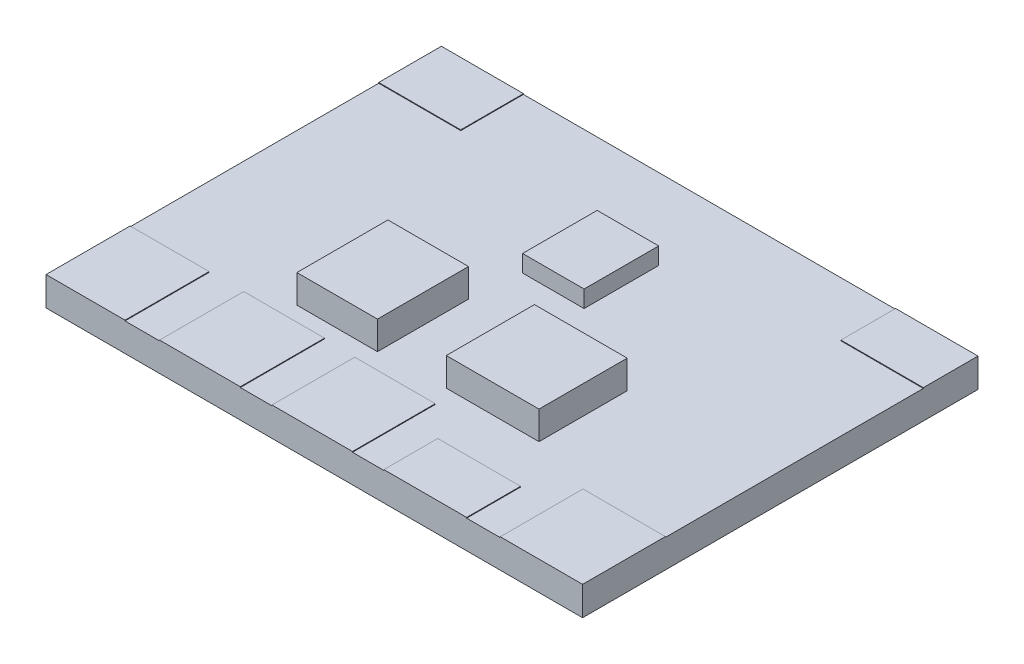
ISO-10303-21;
HEADER;
FILE_DESCRIPTION(('STEP AP214'),'2;1');
FILE_NAME('part.step','',(''),(''),'','','');
FILE_SCHEMA(('AUTOMOTIVE_DESIGN { 1 0 10303 214 1 1 1 1 }'));
ENDSEC;
DATA;
#1=APPLICATION_CONTEXT('core data for automotive mechanical design processes');
#2=APPLICATION_PROTOCOL_DEFINITION('international standard','automotive_design',2000,#1);
#3=PRODUCT_CONTEXT('',#1,'mechanical');
#4=PRODUCT('Part','Part','',(#3));
#5=PRODUCT_RELATED_PRODUCT_CATEGORY('part','',(#4));
#6=PRODUCT_DEFINITION_FORMATION('','',#4);
#7=PRODUCT_DEFINITION_CONTEXT('part definition',#1,'design');
#8=PRODUCT_DEFINITION('design','',#6,#7);
#9=PRODUCT_DEFINITION_SHAPE('','',#8);
#10=(LENGTH_UNIT() NAMED_UNIT(*) SI_UNIT(.MILLI.,.METRE.));
#11=(NAMED_UNIT(*) PLANE_ANGLE_UNIT() SI_UNIT($,.RADIAN.));
#12=(NAMED_UNIT(*) SI_UNIT($,.STERADIAN.) SOLID_ANGLE_UNIT());
#13=UNCERTAINTY_MEASURE_WITH_UNIT(LENGTH_MEASURE(1.E-05),#10,'distance_accuracy_value','');
#14=(GEOMETRIC_REPRESENTATION_CONTEXT(3) GLOBAL_UNCERTAINTY_ASSIGNED_CONTEXT((#13)) GLOBAL_UNIT_ASSIGNED_CONTEXT((#10,
#11,#12)) REPRESENTATION_CONTEXT('',''));
#15=CARTESIAN_POINT('',(0.,0.,0.));
#16=DIRECTION('',(0.,0.,1.));
#17=DIRECTION('',(1.,0.,0.));
#18=AXIS2_PLACEMENT_3D('',#15,#16,#17);
#19=CARTESIAN_POINT('',(0.,2.,0.));
#20=DIRECTION('',(0.,1.,0.));
#21=DIRECTION('',(0.,0.,1.));
#22=AXIS2_PLACEMENT_3D('',#19,#20,#21);
#23=PLANE('',#22);
#24=DIRECTION('',(1.,0.,0.));
#25=VECTOR('',#24,1.);
#26=CARTESIAN_POINT('',(-8.28891681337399,2.,6.94510530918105));
#27=LINE('',#26,#25);
#28=CARTESIAN_POINT('',(-8.28891681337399,2.,6.94510530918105));
#29=VERTEX_POINT('',#28);
#30=CARTESIAN_POINT('',(-2.58045716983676,2.,6.94510530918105));
#31=VERTEX_POINT('',#30);
#32=EDGE_CURVE('E549',#29,#31,#27,.T.);
#33=ORIENTED_EDGE('',*,*,#32,.F.);
#34=DIRECTION('',(0.,0.,1.));
#35=VECTOR('',#34,1.);
#36=CARTESIAN_POINT('',(-8.28891681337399,2.,0.498138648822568));
#37=LINE('',#36,#35);
#38=CARTESIAN_POINT('',(-8.28891681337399,2.,0.498138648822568));
#39=VERTEX_POINT('',#38);
#40=EDGE_CURVE('E535',#39,#29,#37,.T.);
#41=ORIENTED_EDGE('',*,*,#40,.F.);
#42=DIRECTION('',(-1.,0.,0.));
#43=VECTOR('',#42,1.);
#44=CARTESIAN_POINT('',(-8.28891681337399,2.,0.498138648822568));
#45=LINE('',#44,#43);
#46=CARTESIAN_POINT('',(-2.58045716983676,2.,0.498138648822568));
#47=VERTEX_POINT('',#46);
#48=EDGE_CURVE('E540',#47,#39,#45,.T.);
#49=ORIENTED_EDGE('',*,*,#48,.F.);
#50=DIRECTION('',(0.,0.,-1.));
#51=VECTOR('',#50,1.);
#52=CARTESIAN_POINT('',(-2.58045716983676,2.,0.498138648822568));
#53=LINE('',#52,#51);
#54=EDGE_CURVE('E551',#31,#47,#53,.T.);
#55=ORIENTED_EDGE('',*,*,#54,.F.);
#56=EDGE_LOOP('',(#33,#41,#49,#55));
#57=FACE_BOUND('',#56,.T.);
#58=DIRECTION('',(1.,0.,0.));
#59=VECTOR('',#58,1.);
#60=CARTESIAN_POINT('',(2.09010072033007,2.,6.74550881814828));
#61=LINE('',#60,#59);
#62=CARTESIAN_POINT('',(2.09010072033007,2.,6.74550881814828));
#63=VERTEX_POINT('',#62);
#64=CARTESIAN_POINT('',(8.65682527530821,2.,6.74550881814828));
#65=VERTEX_POINT('',#64);
#66=EDGE_CURVE('E520',#63,#65,#61,.T.);
#67=ORIENTED_EDGE('',*,*,#66,.F.);
#68=DIRECTION('',(0.,0.,1.));
#69=VECTOR('',#68,1.);
#70=CARTESIAN_POINT('',(2.09010072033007,2.,0.498138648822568));
#71=LINE('',#70,#69);
#72=CARTESIAN_POINT('',(2.09010072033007,2.,0.498138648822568));
#73=VERTEX_POINT('',#72);
#74=EDGE_CURVE('E506',#73,#63,#71,.T.);
#75=ORIENTED_EDGE('',*,*,#74,.F.);
#76=DIRECTION('',(-1.,0.,0.));
#77=VECTOR('',#76,1.);
#78=CARTESIAN_POINT('',(2.09010072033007,2.,0.498138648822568));
#79=LINE('',#78,#77);
#80=CARTESIAN_POINT('',(8.65682527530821,2.,0.498138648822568));
#81=VERTEX_POINT('',#80);
#82=EDGE_CURVE('E511',#81,#73,#79,.T.);
#83=ORIENTED_EDGE('',*,*,#82,.F.);
#84=DIRECTION('',(0.,0.,-1.));
#85=VECTOR('',#84,1.);
#86=CARTESIAN_POINT('',(8.65682527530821,2.,0.498138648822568));
#87=LINE('',#86,#85);
#88=EDGE_CURVE('E522',#65,#81,#87,.T.);
#89=ORIENTED_EDGE('',*,*,#88,.F.);
#90=EDGE_LOOP('',(#67,#75,#83,#89));
#91=FACE_BOUND('',#90,.T.);
#92=DIRECTION('',(0.,0.,1.));
#93=VECTOR('',#92,1.);
#94=CARTESIAN_POINT('',(-2.26741724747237,2.,-8.29788370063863));
#95=LINE('',#94,#93);
#96=CARTESIAN_POINT('',(-2.26741724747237,2.,-8.29788370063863));
#97=VERTEX_POINT('',#96);
#98=CARTESIAN_POINT('',(-2.26741724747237,2.,-3.0157017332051));
#99=VERTEX_POINT('',#98);
#100=EDGE_CURVE('E491',#97,#99,#95,.T.);
#101=ORIENTED_EDGE('',*,*,#100,.F.);
#102=DIRECTION('',(-1.,0.,0.));
#103=VECTOR('',#102,1.);
#104=CARTESIAN_POINT('',(-2.26741724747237,2.,-8.29788370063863));
#105=LINE('',#104,#103);
#106=CARTESIAN_POINT('',(2.09010072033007,2.,-8.29788370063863));
#107=VERTEX_POINT('',#106);
#108=EDGE_CURVE('E477',#107,#97,#105,.T.);
#109=ORIENTED_EDGE('',*,*,#108,.F.);
#110=DIRECTION('',(0.,0.,-1.));
#111=VECTOR('',#110,1.);
#112=CARTESIAN_POINT('',(2.09010072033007,2.,-8.29788370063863));
#113=LINE('',#112,#111);
#114=CARTESIAN_POINT('',(2.09010072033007,2.,-3.0157017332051));
#115=VERTEX_POINT('',#114);
#116=EDGE_CURVE('E482',#115,#107,#113,.T.);
#117=ORIENTED_EDGE('',*,*,#116,.F.);
#118=DIRECTION('',(1.,0.,0.));
#119=VECTOR('',#118,1.);
#120=CARTESIAN_POINT('',(-2.26741724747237,2.,-3.0157017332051));
#121=LINE('',#120,#119);
#122=EDGE_CURVE('E493',#99,#115,#121,.T.);
#123=ORIENTED_EDGE('',*,*,#122,.F.);
#124=EDGE_LOOP('',(#101,#109,#117,#123));
#125=FACE_BOUND('',#124,.T.);
#126=DIRECTION('',(1.,0.,0.));
#127=VECTOR('',#126,1.);
#128=CARTESIAN_POINT('',(19.,2.,14.));
#129=LINE('',#128,#127);
#130=CARTESIAN_POINT('',(-13.4052461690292,2.,14.));
#131=VERTEX_POINT('',#130);
#132=CARTESIAN_POINT('',(-10.9568034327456,2.,14.));
#133=VERTEX_POINT('',#132);
#134=EDGE_CURVE('E569',#131,#133,#129,.T.);
#135=ORIENTED_EDGE('',*,*,#134,.T.);
#136=DIRECTION('',(0.,0.,1.));
#137=VECTOR('',#136,1.);
#138=CARTESIAN_POINT('',(-10.9568034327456,2.,8.04169922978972));
#139=LINE('',#138,#137);
#140=CARTESIAN_POINT('',(-10.9568034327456,2.,8.04169922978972));
#141=VERTEX_POINT('',#140);
#142=EDGE_CURVE('E56',#141,#133,#139,.T.);
#143=ORIENTED_EDGE('',*,*,#142,.F.);
#144=DIRECTION('',(-1.,0.,0.));
#145=VECTOR('',#144,1.);
#146=CARTESIAN_POINT('',(-10.9568034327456,2.,8.04169922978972));
#147=LINE('',#146,#145);
#148=CARTESIAN_POINT('',(-5.23953587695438,2.,8.04169922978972));
#149=VERTEX_POINT('',#148);
#150=EDGE_CURVE('E51',#149,#141,#147,.T.);
#151=ORIENTED_EDGE('',*,*,#150,.F.);
#152=DIRECTION('',(0.,0.,-1.));
#153=VECTOR('',#152,1.);
#154=CARTESIAN_POINT('',(-5.23953587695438,2.,8.04169922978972));
#155=LINE('',#154,#153);
#156=CARTESIAN_POINT('',(-5.23953587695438,2.,14.));
#157=VERTEX_POINT('',#156);
#158=EDGE_CURVE('E1050',#157,#149,#155,.T.);
#159=ORIENTED_EDGE('',*,*,#158,.F.);
#160=CARTESIAN_POINT('',(-2.99936453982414,2.,14.));
#161=VERTEX_POINT('',#160);
#162=EDGE_CURVE('E572',#157,#161,#129,.T.);
#163=ORIENTED_EDGE('',*,*,#162,.T.);
#164=DIRECTION('',(0.,0.,1.));
#165=VECTOR('',#164,1.);
#166=CARTESIAN_POINT('',(-2.99936453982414,2.,8.13834828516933));
#167=LINE('',#166,#165);
#168=CARTESIAN_POINT('',(-2.99936453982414,2.,8.13834828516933));
#169=VERTEX_POINT('',#168);
#170=EDGE_CURVE('E347',#169,#161,#167,.T.);
#171=ORIENTED_EDGE('',*,*,#170,.F.);
#172=DIRECTION('',(-1.,0.,0.));
#173=VECTOR('',#172,1.);
#174=CARTESIAN_POINT('',(2.70292972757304,2.,8.13834828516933));
#175=LINE('',#174,#173);
#176=CARTESIAN_POINT('',(2.70292972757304,2.,8.13834828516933));
#177=VERTEX_POINT('',#176);
#178=EDGE_CURVE('E356',#177,#169,#175,.T.);
#179=ORIENTED_EDGE('',*,*,#178,.F.);
#180=DIRECTION('',(0.,0.,-1.));
#181=VECTOR('',#180,1.);
#182=CARTESIAN_POINT('',(2.70292972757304,2.,8.13834828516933));
#183=LINE('',#182,#181);
#184=CARTESIAN_POINT('',(2.70292972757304,2.,14.));
#185=VERTEX_POINT('',#184);
#186=EDGE_CURVE('E342',#185,#177,#183,.T.);
#187=ORIENTED_EDGE('',*,*,#186,.F.);
#188=CARTESIAN_POINT('',(4.92585800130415,2.,14.));
#189=VERTEX_POINT('',#188);
#190=EDGE_CURVE('E1057',#185,#189,#129,.T.);
#191=ORIENTED_EDGE('',*,*,#190,.T.);
#192=DIRECTION('',(0.,0.,1.));
#193=VECTOR('',#192,1.);
#194=CARTESIAN_POINT('',(4.92585800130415,2.,10.1840866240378));
#195=LINE('',#194,#193);
#196=CARTESIAN_POINT('',(4.92585800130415,2.,10.1840866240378));
#197=VERTEX_POINT('',#196);
#198=EDGE_CURVE('E377',#197,#189,#195,.T.);
#199=ORIENTED_EDGE('',*,*,#198,.F.);
#200=DIRECTION('',(-1.,0.,0.));
#201=VECTOR('',#200,1.);
#202=CARTESIAN_POINT('',(10.7892340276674,2.,10.1840866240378));
#203=LINE('',#202,#201);
#204=CARTESIAN_POINT('',(10.7892340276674,2.,10.1840866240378));
#205=VERTEX_POINT('',#204);
#206=EDGE_CURVE('E386',#205,#197,#203,.T.);
#207=ORIENTED_EDGE('',*,*,#206,.F.);
#208=DIRECTION('',(0.,0.,-1.));
#209=VECTOR('',#208,1.);
#210=CARTESIAN_POINT('',(10.7892340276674,2.,10.1840866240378));
#211=LINE('',#210,#209);
#212=CARTESIAN_POINT('',(10.7892340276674,2.,14.));
#213=VERTEX_POINT('',#212);
#214=EDGE_CURVE('E372',#213,#205,#211,.T.);
#215=ORIENTED_EDGE('',*,*,#214,.F.);
#216=CARTESIAN_POINT('',(13.1650153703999,2.,14.));
#217=VERTEX_POINT('',#216);
#218=EDGE_CURVE('E567',#213,#217,#129,.T.);
#219=ORIENTED_EDGE('',*,*,#218,.T.);
#220=DIRECTION('',(0.,0.,1.));
#221=VECTOR('',#220,1.);
#222=CARTESIAN_POINT('',(13.1650153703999,2.,14.));
#223=LINE('',#222,#221);
#224=CARTESIAN_POINT('',(13.1650153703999,2.,8.13834828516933));
#225=VERTEX_POINT('',#224);
#226=EDGE_CURVE('E402',#225,#217,#223,.T.);
#227=ORIENTED_EDGE('',*,*,#226,.F.);
#228=DIRECTION('',(-1.,0.,0.));
#229=VECTOR('',#228,1.);
#230=CARTESIAN_POINT('',(13.1650153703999,2.,8.13834828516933));
#231=LINE('',#230,#229);
#232=CARTESIAN_POINT('',(19.,2.,8.13834828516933));
#233=VERTEX_POINT('',#232);
#234=EDGE_CURVE('E407',#233,#225,#231,.T.);
#235=ORIENTED_EDGE('',*,*,#234,.F.);
#236=DIRECTION('',(0.,0.,-1.));
#237=VECTOR('',#236,1.);
#238=CARTESIAN_POINT('',(19.,2.,14.));
#239=LINE('',#238,#237);
#240=CARTESIAN_POINT('',(19.,2.,-10.1280863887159));
#241=VERTEX_POINT('',#240);
#242=EDGE_CURVE('E571',#233,#241,#239,.T.);
#243=ORIENTED_EDGE('',*,*,#242,.T.);
#244=DIRECTION('',(1.,0.,0.));
#245=VECTOR('',#244,1.);
#246=CARTESIAN_POINT('',(13.1650153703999,2.,-10.1280863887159));
#247=LINE('',#246,#245);
#248=CARTESIAN_POINT('',(13.1650153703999,2.,-10.1280863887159));
#249=VERTEX_POINT('',#248);
#250=EDGE_CURVE('E432',#249,#241,#247,.T.);
#251=ORIENTED_EDGE('',*,*,#250,.F.);
#252=DIRECTION('',(0.,0.,1.));
#253=VECTOR('',#252,1.);
#254=CARTESIAN_POINT('',(13.1650153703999,2.,-14.));
#255=LINE('',#254,#253);
#256=CARTESIAN_POINT('',(13.1650153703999,2.,-14.));
#257=VERTEX_POINT('',#256);
#258=EDGE_CURVE('E427',#257,#249,#255,.T.);
#259=ORIENTED_EDGE('',*,*,#258,.F.);
#260=DIRECTION('',(-1.,0.,0.));
#261=VECTOR('',#260,1.);
#262=CARTESIAN_POINT('',(19.,2.,-14.));
#263=LINE('',#262,#261);
#264=CARTESIAN_POINT('',(-13.188964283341,2.,-14.));
#265=VERTEX_POINT('',#264);
#266=EDGE_CURVE('E574',#257,#265,#263,.T.);
#267=ORIENTED_EDGE('',*,*,#266,.T.);
#268=DIRECTION('',(0.,0.,-1.));
#269=VECTOR('',#268,1.);
#270=CARTESIAN_POINT('',(-13.188964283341,2.,-14.));
#271=LINE('',#270,#269);
#272=CARTESIAN_POINT('',(-13.188964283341,2.,-9.55976273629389));
#273=VERTEX_POINT('',#272);
#274=EDGE_CURVE('E457',#273,#265,#271,.T.);
#275=ORIENTED_EDGE('',*,*,#274,.F.);
#276=DIRECTION('',(1.,0.,0.));
#277=VECTOR('',#276,1.);
#278=CARTESIAN_POINT('',(-19.,2.,-9.55976273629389));
#279=LINE('',#278,#277);
#280=CARTESIAN_POINT('',(-19.,2.,-9.55976273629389));
#281=VERTEX_POINT('',#280);
#282=EDGE_CURVE('E452',#281,#273,#279,.T.);
#283=ORIENTED_EDGE('',*,*,#282,.F.);
#284=DIRECTION('',(0.,0.,1.));
#285=VECTOR('',#284,1.);
#286=CARTESIAN_POINT('',(-19.,2.,14.));
#287=LINE('',#286,#285);
#288=CARTESIAN_POINT('',(-19.,2.,8.04169922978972));
#289=VERTEX_POINT('',#288);
#290=EDGE_CURVE('E565',#281,#289,#287,.T.);
#291=ORIENTED_EDGE('',*,*,#290,.T.);
#292=DIRECTION('',(-1.,0.,0.));
#293=VECTOR('',#292,1.);
#294=CARTESIAN_POINT('',(-19.,2.,8.04169922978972));
#295=LINE('',#294,#293);
#296=CARTESIAN_POINT('',(-13.4052461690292,2.,8.04169922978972));
#297=VERTEX_POINT('',#296);
#298=EDGE_CURVE('E316',#297,#289,#295,.T.);
#299=ORIENTED_EDGE('',*,*,#298,.F.);
#300=DIRECTION('',(0.,0.,-1.));
#301=VECTOR('',#300,1.);
#302=CARTESIAN_POINT('',(-13.4052461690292,2.,8.04169922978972));
#303=LINE('',#302,#301);
#304=EDGE_CURVE('E313',#131,#297,#303,.T.);
#305=ORIENTED_EDGE('',*,*,#304,.F.);
#306=EDGE_LOOP('',(#135,#143,#151,#159,#163,#171,#179,#187,#191,#199,#207,#215,#219,#227,#235,
#243,#251,#259,#267,#275,#283,#291,#299,#305));
#307=FACE_BOUND('',#306,.T.);
#308=ADVANCED_FACE('F36',(#57,#91,#125,#307),#23,.T.);
#309=CARTESIAN_POINT('',(-19.,2.,14.));
#310=DIRECTION('',(1.,0.,0.));
#311=DIRECTION('',(0.,0.,-1.));
#312=AXIS2_PLACEMENT_3D('',#309,#310,#311);
#313=PLANE('',#312);
#314=DIRECTION('',(0.,0.,1.));
#315=VECTOR('',#314,1.);
#316=CARTESIAN_POINT('',(-19.,0.,14.));
#317=LINE('',#316,#315);
#318=CARTESIAN_POINT('',(-19.,0.,-14.));
#319=VERTEX_POINT('',#318);
#320=CARTESIAN_POINT('',(-19.,0.,14.));
#321=VERTEX_POINT('',#320);
#322=EDGE_CURVE('E564',#319,#321,#317,.T.);
#323=ORIENTED_EDGE('',*,*,#322,.T.);
#324=DIRECTION('',(0.,-1.,0.));
#325=VECTOR('',#324,1.);
#326=CARTESIAN_POINT('',(-19.,2.,14.));
#327=LINE('',#326,#325);
#328=CARTESIAN_POINT('',(-19.,2.05,14.));
#329=VERTEX_POINT('',#328);
#330=EDGE_CURVE('E11',#329,#321,#327,.T.);
#331=ORIENTED_EDGE('',*,*,#330,.F.);
#332=DIRECTION('',(0.,0.,1.));
#333=VECTOR('',#332,1.);
#334=CARTESIAN_POINT('',(-19.,2.05,8.04169922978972));
#335=LINE('',#334,#333);
#336=CARTESIAN_POINT('',(-19.,2.05,8.04169922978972));
#337=VERTEX_POINT('',#336);
#338=EDGE_CURVE('E322',#337,#329,#335,.T.);
#339=ORIENTED_EDGE('',*,*,#338,.F.);
#340=DIRECTION('',(0.,-1.,0.));
#341=VECTOR('',#340,1.);
#342=CARTESIAN_POINT('',(-19.,2.05,8.04169922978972));
#343=LINE('',#342,#341);
#344=EDGE_CURVE('E330',#337,#289,#343,.T.);
#345=ORIENTED_EDGE('',*,*,#344,.T.);
#346=ORIENTED_EDGE('',*,*,#290,.F.);
#347=DIRECTION('',(0.,-1.,0.));
#348=VECTOR('',#347,1.);
#349=CARTESIAN_POINT('',(-19.,2.05,-9.55976273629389));
#350=LINE('',#349,#348);
#351=CARTESIAN_POINT('',(-19.,2.05,-9.55976273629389));
#352=VERTEX_POINT('',#351);
#353=EDGE_CURVE('E474',#352,#281,#350,.T.);
#354=ORIENTED_EDGE('',*,*,#353,.F.);
#355=DIRECTION('',(0.,0.,1.));
#356=VECTOR('',#355,1.);
#357=CARTESIAN_POINT('',(-19.,2.05,-14.));
#358=LINE('',#357,#356);
#359=CARTESIAN_POINT('',(-19.,2.05,-14.));
#360=VERTEX_POINT('',#359);
#361=EDGE_CURVE('E453',#360,#352,#358,.T.);
#362=ORIENTED_EDGE('',*,*,#361,.F.);
#363=DIRECTION('',(0.,-1.,0.));
#364=VECTOR('',#363,1.);
#365=CARTESIAN_POINT('',(-19.,2.,-14.));
#366=LINE('',#365,#364);
#367=EDGE_CURVE('E576',#360,#319,#366,.T.);
#368=ORIENTED_EDGE('',*,*,#367,.T.);
#369=EDGE_LOOP('',(#323,#331,#339,#345,#346,#354,#362,#368));
#370=FACE_BOUND('',#369,.T.);
#371=ADVANCED_FACE('F38',(#370),#313,.F.);
#372=CARTESIAN_POINT('',(19.,2.,14.));
#373=DIRECTION('',(0.,0.,-1.));
#374=DIRECTION('',(-1.,0.,0.));
#375=AXIS2_PLACEMENT_3D('',#372,#373,#374);
#376=PLANE('',#375);
#377=DIRECTION('',(1.,0.,0.));
#378=VECTOR('',#377,1.);
#379=CARTESIAN_POINT('',(19.,0.,14.));
#380=LINE('',#379,#378);
#381=CARTESIAN_POINT('',(19.,0.,14.));
#382=VERTEX_POINT('',#381);
#383=EDGE_CURVE('E579',#321,#382,#380,.T.);
#384=ORIENTED_EDGE('',*,*,#383,.T.);
#385=DIRECTION('',(0.,-1.,0.));
#386=VECTOR('',#385,1.);
#387=CARTESIAN_POINT('',(19.,2.,14.));
#388=LINE('',#387,#386);
#389=CARTESIAN_POINT('',(19.,2.05,14.));
#390=VERTEX_POINT('',#389);
#391=EDGE_CURVE('E44',#390,#382,#388,.T.);
#392=ORIENTED_EDGE('',*,*,#391,.F.);
#393=DIRECTION('',(1.,0.,0.));
#394=VECTOR('',#393,1.);
#395=CARTESIAN_POINT('',(13.1650153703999,2.05,14.));
#396=LINE('',#395,#394);
#397=CARTESIAN_POINT('',(13.1650153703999,2.05,14.));
#398=VERTEX_POINT('',#397);
#399=EDGE_CURVE('E406',#398,#390,#396,.T.);
#400=ORIENTED_EDGE('',*,*,#399,.F.);
#401=DIRECTION('',(0.,-1.,0.));
#402=VECTOR('',#401,1.);
#403=CARTESIAN_POINT('',(13.1650153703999,2.05,14.));
#404=LINE('',#403,#402);
#405=EDGE_CURVE('E424',#398,#217,#404,.T.);
#406=ORIENTED_EDGE('',*,*,#405,.T.);
#407=ORIENTED_EDGE('',*,*,#218,.F.);
#408=DIRECTION('',(0.,-1.,0.));
#409=VECTOR('',#408,1.);
#410=CARTESIAN_POINT('',(10.7892340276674,2.05,14.));
#411=LINE('',#410,#409);
#412=CARTESIAN_POINT('',(10.7892340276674,2.05,14.));
#413=VERTEX_POINT('',#412);
#414=EDGE_CURVE('E383',#413,#213,#411,.T.);
#415=ORIENTED_EDGE('',*,*,#414,.F.);
#416=DIRECTION('',(1.,0.,0.));
#417=VECTOR('',#416,1.);
#418=CARTESIAN_POINT('',(10.7892340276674,2.05,14.));
#419=LINE('',#418,#417);
#420=CARTESIAN_POINT('',(4.92585800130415,2.05,14.));
#421=VERTEX_POINT('',#420);
#422=EDGE_CURVE('E381',#421,#413,#419,.T.);
#423=ORIENTED_EDGE('',*,*,#422,.F.);
#424=DIRECTION('',(0.,-1.,0.));
#425=VECTOR('',#424,1.);
#426=CARTESIAN_POINT('',(4.92585800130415,2.05,14.));
#427=LINE('',#426,#425);
#428=EDGE_CURVE('E393',#421,#189,#427,.T.);
#429=ORIENTED_EDGE('',*,*,#428,.T.);
#430=ORIENTED_EDGE('',*,*,#190,.F.);
#431=DIRECTION('',(0.,-1.,0.));
#432=VECTOR('',#431,1.);
#433=CARTESIAN_POINT('',(2.70292972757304,2.05,14.));
#434=LINE('',#433,#432);
#435=CARTESIAN_POINT('',(2.70292972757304,2.05,14.));
#436=VERTEX_POINT('',#435);
#437=EDGE_CURVE('E353',#436,#185,#434,.T.);
#438=ORIENTED_EDGE('',*,*,#437,.F.);
#439=DIRECTION('',(1.,0.,0.));
#440=VECTOR('',#439,1.);
#441=CARTESIAN_POINT('',(2.70292972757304,2.05,14.));
#442=LINE('',#441,#440);
#443=CARTESIAN_POINT('',(-2.99936453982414,2.05,14.));
#444=VERTEX_POINT('',#443);
#445=EDGE_CURVE('E351',#444,#436,#442,.T.);
#446=ORIENTED_EDGE('',*,*,#445,.F.);
#447=DIRECTION('',(0.,-1.,0.));
#448=VECTOR('',#447,1.);
#449=CARTESIAN_POINT('',(-2.99936453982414,2.05,14.));
#450=LINE('',#449,#448);
#451=EDGE_CURVE('E363',#444,#161,#450,.T.);
#452=ORIENTED_EDGE('',*,*,#451,.T.);
#453=ORIENTED_EDGE('',*,*,#162,.F.);
#454=DIRECTION('',(0.,-1.,0.));
#455=VECTOR('',#454,1.);
#456=CARTESIAN_POINT('',(-5.23953587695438,2.05,14.));
#457=LINE('',#456,#455);
#458=CARTESIAN_POINT('',(-5.23953587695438,2.05,14.));
#459=VERTEX_POINT('',#458);
#460=EDGE_CURVE('E298',#459,#157,#457,.T.);
#461=ORIENTED_EDGE('',*,*,#460,.F.);
#462=DIRECTION('',(1.,0.,0.));
#463=VECTOR('',#462,1.);
#464=CARTESIAN_POINT('',(-10.9568034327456,2.05,14.));
#465=LINE('',#464,#463);
#466=CARTESIAN_POINT('',(-10.9568034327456,2.05,14.));
#467=VERTEX_POINT('',#466);
#468=EDGE_CURVE('E292',#467,#459,#465,.T.);
#469=ORIENTED_EDGE('',*,*,#468,.F.);
#470=DIRECTION('',(0.,-1.,0.));
#471=VECTOR('',#470,1.);
#472=CARTESIAN_POINT('',(-10.9568034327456,2.05,14.));
#473=LINE('',#472,#471);
#474=EDGE_CURVE('E296',#467,#133,#473,.T.);
#475=ORIENTED_EDGE('',*,*,#474,.T.);
#476=ORIENTED_EDGE('',*,*,#134,.F.);
#477=DIRECTION('',(0.,-1.,0.));
#478=VECTOR('',#477,1.);
#479=CARTESIAN_POINT('',(-13.4052461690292,2.05,14.));
#480=LINE('',#479,#478);
#481=CARTESIAN_POINT('',(-13.4052461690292,2.05,14.));
#482=VERTEX_POINT('',#481);
#483=EDGE_CURVE('E339',#482,#131,#480,.T.);
#484=ORIENTED_EDGE('',*,*,#483,.F.);
#485=DIRECTION('',(1.,0.,0.));
#486=VECTOR('',#485,1.);
#487=CARTESIAN_POINT('',(-19.,2.05,14.));
#488=LINE('',#487,#486);
#489=EDGE_CURVE('E325',#329,#482,#488,.T.);
#490=ORIENTED_EDGE('',*,*,#489,.F.);
#491=ORIENTED_EDGE('',*,*,#330,.T.);
#492=EDGE_LOOP('',(#384,#392,#400,#406,#407,#415,#423,#429,#430,#438,#446,#452,#453,#461,#469,
#475,#476,#484,#490,#491));
#493=FACE_BOUND('',#492,.T.);
#494=ADVANCED_FACE('F294',(#493),#376,.F.);
#495=CARTESIAN_POINT('',(19.,2.,14.));
#496=DIRECTION('',(-1.,0.,0.));
#497=DIRECTION('',(0.,0.,1.));
#498=AXIS2_PLACEMENT_3D('',#495,#496,#497);
#499=PLANE('',#498);
#500=DIRECTION('',(0.,0.,-1.));
#501=VECTOR('',#500,1.);
#502=CARTESIAN_POINT('',(19.,0.,14.));
#503=LINE('',#502,#501);
#504=CARTESIAN_POINT('',(19.,0.,-14.));
#505=VERTEX_POINT('',#504);
#506=EDGE_CURVE('E581',#382,#505,#503,.T.);
#507=ORIENTED_EDGE('',*,*,#506,.T.);
#508=DIRECTION('',(0.,-1.,0.));
#509=VECTOR('',#508,1.);
#510=CARTESIAN_POINT('',(19.,2.,-14.));
#511=LINE('',#510,#509);
#512=CARTESIAN_POINT('',(19.,2.05,-14.));
#513=VERTEX_POINT('',#512);
#514=EDGE_CURVE('E586',#513,#505,#511,.T.);
#515=ORIENTED_EDGE('',*,*,#514,.F.);
#516=DIRECTION('',(0.,0.,-1.));
#517=VECTOR('',#516,1.);
#518=CARTESIAN_POINT('',(19.,2.05,-14.));
#519=LINE('',#518,#517);
#520=CARTESIAN_POINT('',(19.,2.05,-10.1280863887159));
#521=VERTEX_POINT('',#520);
#522=EDGE_CURVE('E434',#521,#513,#519,.T.);
#523=ORIENTED_EDGE('',*,*,#522,.F.);
#524=DIRECTION('',(0.,-1.,0.));
#525=VECTOR('',#524,1.);
#526=CARTESIAN_POINT('',(19.,2.05,-10.1280863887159));
#527=LINE('',#526,#525);
#528=EDGE_CURVE('E446',#521,#241,#527,.T.);
#529=ORIENTED_EDGE('',*,*,#528,.T.);
#530=ORIENTED_EDGE('',*,*,#242,.F.);
#531=DIRECTION('',(0.,-1.,0.));
#532=VECTOR('',#531,1.);
#533=CARTESIAN_POINT('',(19.,2.05,8.13834828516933));
#534=LINE('',#533,#532);
#535=CARTESIAN_POINT('',(19.,2.05,8.13834828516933));
#536=VERTEX_POINT('',#535);
#537=EDGE_CURVE('E421',#536,#233,#534,.T.);
#538=ORIENTED_EDGE('',*,*,#537,.F.);
#539=DIRECTION('',(0.,0.,-1.));
#540=VECTOR('',#539,1.);
#541=CARTESIAN_POINT('',(19.,2.05,14.));
#542=LINE('',#541,#540);
#543=EDGE_CURVE('E410',#390,#536,#542,.T.);
#544=ORIENTED_EDGE('',*,*,#543,.F.);
#545=ORIENTED_EDGE('',*,*,#391,.T.);
#546=EDGE_LOOP('',(#507,#515,#523,#529,#530,#538,#544,#545));
#547=FACE_BOUND('',#546,.T.);
#548=ADVANCED_FACE('F592',(#547),#499,.F.);
#549=CARTESIAN_POINT('',(19.,2.,-14.));
#550=DIRECTION('',(0.,0.,1.));
#551=DIRECTION('',(1.,0.,0.));
#552=AXIS2_PLACEMENT_3D('',#549,#550,#551);
#553=PLANE('',#552);
#554=DIRECTION('',(-1.,0.,0.));
#555=VECTOR('',#554,1.);
#556=CARTESIAN_POINT('',(19.,0.,-14.));
#557=LINE('',#556,#555);
#558=EDGE_CURVE('E568',#505,#319,#557,.T.);
#559=ORIENTED_EDGE('',*,*,#558,.T.);
#560=ORIENTED_EDGE('',*,*,#367,.F.);
#561=DIRECTION('',(-1.,0.,0.));
#562=VECTOR('',#561,1.);
#563=CARTESIAN_POINT('',(-19.,2.05,-14.));
#564=LINE('',#563,#562);
#565=CARTESIAN_POINT('',(-13.188964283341,2.05,-14.));
#566=VERTEX_POINT('',#565);
#567=EDGE_CURVE('E461',#566,#360,#564,.T.);
#568=ORIENTED_EDGE('',*,*,#567,.F.);
#569=DIRECTION('',(0.,-1.,0.));
#570=VECTOR('',#569,1.);
#571=CARTESIAN_POINT('',(-13.188964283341,2.05,-14.));
#572=LINE('',#571,#570);
#573=EDGE_CURVE('E464',#566,#265,#572,.T.);
#574=ORIENTED_EDGE('',*,*,#573,.T.);
#575=ORIENTED_EDGE('',*,*,#266,.F.);
#576=DIRECTION('',(0.,-1.,0.));
#577=VECTOR('',#576,1.);
#578=CARTESIAN_POINT('',(13.1650153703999,2.05,-14.));
#579=LINE('',#578,#577);
#580=CARTESIAN_POINT('',(13.1650153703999,2.05,-14.));
#581=VERTEX_POINT('',#580);
#582=EDGE_CURVE('E439',#581,#257,#579,.T.);
#583=ORIENTED_EDGE('',*,*,#582,.F.);
#584=DIRECTION('',(-1.,0.,0.));
#585=VECTOR('',#584,1.);
#586=CARTESIAN_POINT('',(13.1650153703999,2.05,-14.));
#587=LINE('',#586,#585);
#588=EDGE_CURVE('E437',#513,#581,#587,.T.);
#589=ORIENTED_EDGE('',*,*,#588,.F.);
#590=ORIENTED_EDGE('',*,*,#514,.T.);
#591=EDGE_LOOP('',(#559,#560,#568,#574,#575,#583,#589,#590));
#592=FACE_BOUND('',#591,.T.);
#593=ADVANCED_FACE('F599',(#592),#553,.F.);
#594=CARTESIAN_POINT('',(0.,0.,0.));
#595=DIRECTION('',(0.,1.,0.));
#596=DIRECTION('',(0.,0.,1.));
#597=AXIS2_PLACEMENT_3D('',#594,#595,#596);
#598=PLANE('',#597);
#599=ORIENTED_EDGE('',*,*,#322,.F.);
#600=ORIENTED_EDGE('',*,*,#558,.F.);
#601=ORIENTED_EDGE('',*,*,#506,.F.);
#602=ORIENTED_EDGE('',*,*,#383,.F.);
#603=EDGE_LOOP('',(#599,#600,#601,#602));
#604=FACE_BOUND('',#603,.T.);
#605=ADVANCED_FACE('F597',(#604),#598,.F.);
#606=CARTESIAN_POINT('',(-8.28891681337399,4.,0.498138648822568));
#607=DIRECTION('',(1.,0.,0.));
#608=DIRECTION('',(0.,0.,-1.));
#609=AXIS2_PLACEMENT_3D('',#606,#607,#608);
#610=PLANE('',#609);
#611=ORIENTED_EDGE('',*,*,#40,.T.);
#612=DIRECTION('',(0.,-1.,0.));
#613=VECTOR('',#612,1.);
#614=CARTESIAN_POINT('',(-8.28891681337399,4.,6.94510530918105));
#615=LINE('',#614,#613);
#616=CARTESIAN_POINT('',(-8.28891681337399,4.,6.94510530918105));
#617=VERTEX_POINT('',#616);
#618=EDGE_CURVE('E562',#617,#29,#615,.T.);
#619=ORIENTED_EDGE('',*,*,#618,.F.);
#620=DIRECTION('',(0.,0.,1.));
#621=VECTOR('',#620,1.);
#622=CARTESIAN_POINT('',(-8.28891681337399,4.,0.498138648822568));
#623=LINE('',#622,#621);
#624=CARTESIAN_POINT('',(-8.28891681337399,4.,0.498138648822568));
#625=VERTEX_POINT('',#624);
#626=EDGE_CURVE('E536',#625,#617,#623,.T.);
#627=ORIENTED_EDGE('',*,*,#626,.F.);
#628=DIRECTION('',(0.,-1.,0.));
#629=VECTOR('',#628,1.);
#630=CARTESIAN_POINT('',(-8.28891681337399,4.,0.498138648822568));
#631=LINE('',#630,#629);
#632=EDGE_CURVE('E546',#625,#39,#631,.T.);
#633=ORIENTED_EDGE('',*,*,#632,.T.);
#634=EDGE_LOOP('',(#611,#619,#627,#633));
#635=FACE_BOUND('',#634,.T.);
#636=ADVANCED_FACE('F638',(#635),#610,.F.);
#637=CARTESIAN_POINT('',(-8.28891681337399,4.,6.94510530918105));
#638=DIRECTION('',(0.,0.,-1.));
#639=DIRECTION('',(-1.,0.,0.));
#640=AXIS2_PLACEMENT_3D('',#637,#638,#639);
#641=PLANE('',#640);
#642=ORIENTED_EDGE('',*,*,#32,.T.);
#643=DIRECTION('',(0.,-1.,0.));
#644=VECTOR('',#643,1.);
#645=CARTESIAN_POINT('',(-2.58045716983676,4.,6.94510530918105));
#646=LINE('',#645,#644);
#647=CARTESIAN_POINT('',(-2.58045716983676,4.,6.94510530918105));
#648=VERTEX_POINT('',#647);
#649=EDGE_CURVE('E559',#648,#31,#646,.T.);
#650=ORIENTED_EDGE('',*,*,#649,.F.);
#651=DIRECTION('',(1.,0.,0.));
#652=VECTOR('',#651,1.);
#653=CARTESIAN_POINT('',(-8.28891681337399,4.,6.94510530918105));
#654=LINE('',#653,#652);
#655=EDGE_CURVE('E539',#617,#648,#654,.T.);
#656=ORIENTED_EDGE('',*,*,#655,.F.);
#657=ORIENTED_EDGE('',*,*,#618,.T.);
#658=EDGE_LOOP('',(#642,#650,#656,#657));
#659=FACE_BOUND('',#658,.T.);
#660=ADVANCED_FACE('F668',(#659),#641,.F.);
#661=CARTESIAN_POINT('',(-2.58045716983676,4.,0.498138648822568));
#662=DIRECTION('',(-1.,0.,0.));
#663=DIRECTION('',(0.,0.,1.));
#664=AXIS2_PLACEMENT_3D('',#661,#662,#663);
#665=PLANE('',#664);
#666=ORIENTED_EDGE('',*,*,#54,.T.);
#667=DIRECTION('',(0.,-1.,0.));
#668=VECTOR('',#667,1.);
#669=CARTESIAN_POINT('',(-2.58045716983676,4.,0.498138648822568));
#670=LINE('',#669,#668);
#671=CARTESIAN_POINT('',(-2.58045716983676,4.,0.498138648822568));
#672=VERTEX_POINT('',#671);
#673=EDGE_CURVE('E557',#672,#47,#670,.T.);
#674=ORIENTED_EDGE('',*,*,#673,.F.);
#675=DIRECTION('',(0.,0.,-1.));
#676=VECTOR('',#675,1.);
#677=CARTESIAN_POINT('',(-2.58045716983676,4.,0.498138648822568));
#678=LINE('',#677,#676);
#679=EDGE_CURVE('E542',#648,#672,#678,.T.);
#680=ORIENTED_EDGE('',*,*,#679,.F.);
#681=ORIENTED_EDGE('',*,*,#649,.T.);
#682=EDGE_LOOP('',(#666,#674,#680,#681));
#683=FACE_BOUND('',#682,.T.);
#684=ADVANCED_FACE('F675',(#683),#665,.F.);
#685=CARTESIAN_POINT('',(-8.28891681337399,4.,0.498138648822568));
#686=DIRECTION('',(0.,0.,1.));
#687=DIRECTION('',(1.,0.,0.));
#688=AXIS2_PLACEMENT_3D('',#685,#686,#687);
#689=PLANE('',#688);
#690=ORIENTED_EDGE('',*,*,#48,.T.);
#691=ORIENTED_EDGE('',*,*,#632,.F.);
#692=DIRECTION('',(-1.,0.,0.));
#693=VECTOR('',#692,1.);
#694=CARTESIAN_POINT('',(-8.28891681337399,4.,0.498138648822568));
#695=LINE('',#694,#693);
#696=EDGE_CURVE('E544',#672,#625,#695,.T.);
#697=ORIENTED_EDGE('',*,*,#696,.F.);
#698=ORIENTED_EDGE('',*,*,#673,.T.);
#699=EDGE_LOOP('',(#690,#691,#697,#698));
#700=FACE_BOUND('',#699,.T.);
#701=ADVANCED_FACE('F682',(#700),#689,.F.);
#702=CARTESIAN_POINT('',(0.,4.,0.));
#703=DIRECTION('',(0.,1.,0.));
#704=DIRECTION('',(0.,0.,1.));
#705=AXIS2_PLACEMENT_3D('',#702,#703,#704);
#706=PLANE('',#705);
#707=ORIENTED_EDGE('',*,*,#626,.T.);
#708=ORIENTED_EDGE('',*,*,#655,.T.);
#709=ORIENTED_EDGE('',*,*,#679,.T.);
#710=ORIENTED_EDGE('',*,*,#696,.T.);
#711=EDGE_LOOP('',(#707,#708,#709,#710));
#712=FACE_BOUND('',#711,.T.);
#713=ADVANCED_FACE('F690',(#712),#706,.T.);
#714=CARTESIAN_POINT('',(2.09010072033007,4.,0.498138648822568));
#715=DIRECTION('',(1.,0.,0.));
#716=DIRECTION('',(0.,0.,-1.));
#717=AXIS2_PLACEMENT_3D('',#714,#715,#716);
#718=PLANE('',#717);
#719=ORIENTED_EDGE('',*,*,#74,.T.);
#720=DIRECTION('',(0.,-1.,0.));
#721=VECTOR('',#720,1.);
#722=CARTESIAN_POINT('',(2.09010072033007,4.,6.74550881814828));
#723=LINE('',#722,#721);
#724=CARTESIAN_POINT('',(2.09010072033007,4.,6.74550881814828));
#725=VERTEX_POINT('',#724);
#726=EDGE_CURVE('E533',#725,#63,#723,.T.);
#727=ORIENTED_EDGE('',*,*,#726,.F.);
#728=DIRECTION('',(0.,0.,1.));
#729=VECTOR('',#728,1.);
#730=CARTESIAN_POINT('',(2.09010072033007,4.,0.498138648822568));
#731=LINE('',#730,#729);
#732=CARTESIAN_POINT('',(2.09010072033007,4.,0.498138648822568));
#733=VERTEX_POINT('',#732);
#734=EDGE_CURVE('E507',#733,#725,#731,.T.);
#735=ORIENTED_EDGE('',*,*,#734,.F.);
#736=DIRECTION('',(0.,-1.,0.));
#737=VECTOR('',#736,1.);
#738=CARTESIAN_POINT('',(2.09010072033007,4.,0.498138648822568));
#739=LINE('',#738,#737);
#740=EDGE_CURVE('E517',#733,#73,#739,.T.);
#741=ORIENTED_EDGE('',*,*,#740,.T.);
#742=EDGE_LOOP('',(#719,#727,#735,#741));
#743=FACE_BOUND('',#742,.T.);
#744=ADVANCED_FACE('F698',(#743),#718,.F.);
#745=CARTESIAN_POINT('',(2.09010072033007,4.,6.74550881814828));
#746=DIRECTION('',(0.,0.,-1.));
#747=DIRECTION('',(-1.,0.,0.));
#748=AXIS2_PLACEMENT_3D('',#745,#746,#747);
#749=PLANE('',#748);
#750=ORIENTED_EDGE('',*,*,#66,.T.);
#751=DIRECTION('',(0.,-1.,0.));
#752=VECTOR('',#751,1.);
#753=CARTESIAN_POINT('',(8.65682527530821,4.,6.74550881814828));
#754=LINE('',#753,#752);
#755=CARTESIAN_POINT('',(8.65682527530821,4.,6.74550881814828));
#756=VERTEX_POINT('',#755);
#757=EDGE_CURVE('E530',#756,#65,#754,.T.);
#758=ORIENTED_EDGE('',*,*,#757,.F.);
#759=DIRECTION('',(1.,0.,0.));
#760=VECTOR('',#759,1.);
#761=CARTESIAN_POINT('',(2.09010072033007,4.,6.74550881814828));
#762=LINE('',#761,#760);
#763=EDGE_CURVE('E510',#725,#756,#762,.T.);
#764=ORIENTED_EDGE('',*,*,#763,.F.);
#765=ORIENTED_EDGE('',*,*,#726,.T.);
#766=EDGE_LOOP('',(#750,#758,#764,#765));
#767=FACE_BOUND('',#766,.T.);
#768=ADVANCED_FACE('F706',(#767),#749,.F.);
#769=CARTESIAN_POINT('',(8.65682527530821,4.,0.498138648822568));
#770=DIRECTION('',(-1.,0.,0.));
#771=DIRECTION('',(0.,0.,1.));
#772=AXIS2_PLACEMENT_3D('',#769,#770,#771);
#773=PLANE('',#772);
#774=ORIENTED_EDGE('',*,*,#88,.T.);
#775=DIRECTION('',(0.,-1.,0.));
#776=VECTOR('',#775,1.);
#777=CARTESIAN_POINT('',(8.65682527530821,4.,0.498138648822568));
#778=LINE('',#777,#776);
#779=CARTESIAN_POINT('',(8.65682527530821,4.,0.498138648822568));
#780=VERTEX_POINT('',#779);
#781=EDGE_CURVE('E528',#780,#81,#778,.T.);
#782=ORIENTED_EDGE('',*,*,#781,.F.);
#783=DIRECTION('',(0.,0.,-1.));
#784=VECTOR('',#783,1.);
#785=CARTESIAN_POINT('',(8.65682527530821,4.,0.498138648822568));
#786=LINE('',#785,#784);
#787=EDGE_CURVE('E513',#756,#780,#786,.T.);
#788=ORIENTED_EDGE('',*,*,#787,.F.);
#789=ORIENTED_EDGE('',*,*,#757,.T.);
#790=EDGE_LOOP('',(#774,#782,#788,#789));
#791=FACE_BOUND('',#790,.T.);
#792=ADVANCED_FACE('F714',(#791),#773,.F.);
#793=CARTESIAN_POINT('',(2.09010072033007,4.,0.498138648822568));
#794=DIRECTION('',(0.,0.,1.));
#795=DIRECTION('',(1.,0.,0.));
#796=AXIS2_PLACEMENT_3D('',#793,#794,#795);
#797=PLANE('',#796);
#798=ORIENTED_EDGE('',*,*,#82,.T.);
#799=ORIENTED_EDGE('',*,*,#740,.F.);
#800=DIRECTION('',(-1.,0.,0.));
#801=VECTOR('',#800,1.);
#802=CARTESIAN_POINT('',(2.09010072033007,4.,0.498138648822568));
#803=LINE('',#802,#801);
#804=EDGE_CURVE('E515',#780,#733,#803,.T.);
#805=ORIENTED_EDGE('',*,*,#804,.F.);
#806=ORIENTED_EDGE('',*,*,#781,.T.);
#807=EDGE_LOOP('',(#798,#799,#805,#806));
#808=FACE_BOUND('',#807,.T.);
#809=ADVANCED_FACE('F722',(#808),#797,.F.);
#810=CARTESIAN_POINT('',(0.,4.,0.));
#811=DIRECTION('',(0.,1.,0.));
#812=DIRECTION('',(0.,0.,1.));
#813=AXIS2_PLACEMENT_3D('',#810,#811,#812);
#814=PLANE('',#813);
#815=ORIENTED_EDGE('',*,*,#734,.T.);
#816=ORIENTED_EDGE('',*,*,#763,.T.);
#817=ORIENTED_EDGE('',*,*,#787,.T.);
#818=ORIENTED_EDGE('',*,*,#804,.T.);
#819=EDGE_LOOP('',(#815,#816,#817,#818));
#820=FACE_BOUND('',#819,.T.);
#821=ADVANCED_FACE('F730',(#820),#814,.T.);
#822=CARTESIAN_POINT('',(-2.26741724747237,3.2,-8.29788370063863));
#823=DIRECTION('',(0.,0.,1.));
#824=DIRECTION('',(1.,0.,0.));
#825=AXIS2_PLACEMENT_3D('',#822,#823,#824);
#826=PLANE('',#825);
#827=ORIENTED_EDGE('',*,*,#108,.T.);
#828=DIRECTION('',(0.,-1.,0.));
#829=VECTOR('',#828,1.);
#830=CARTESIAN_POINT('',(-2.26741724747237,3.2,-8.29788370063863));
#831=LINE('',#830,#829);
#832=CARTESIAN_POINT('',(-2.26741724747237,3.2,-8.29788370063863));
#833=VERTEX_POINT('',#832);
#834=EDGE_CURVE('E504',#833,#97,#831,.T.);
#835=ORIENTED_EDGE('',*,*,#834,.F.);
#836=DIRECTION('',(-1.,0.,0.));
#837=VECTOR('',#836,1.);
#838=CARTESIAN_POINT('',(-2.26741724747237,3.2,-8.29788370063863));
#839=LINE('',#838,#837);
#840=CARTESIAN_POINT('',(2.09010072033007,3.2,-8.29788370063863));
#841=VERTEX_POINT('',#840);
#842=EDGE_CURVE('E478',#841,#833,#839,.T.);
#843=ORIENTED_EDGE('',*,*,#842,.F.);
#844=DIRECTION('',(0.,-1.,0.));
#845=VECTOR('',#844,1.);
#846=CARTESIAN_POINT('',(2.09010072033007,3.2,-8.29788370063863));
#847=LINE('',#846,#845);
#848=EDGE_CURVE('E488',#841,#107,#847,.T.);
#849=ORIENTED_EDGE('',*,*,#848,.T.);
#850=EDGE_LOOP('',(#827,#835,#843,#849));
#851=FACE_BOUND('',#850,.T.);
#852=ADVANCED_FACE('F738',(#851),#826,.F.);
#853=CARTESIAN_POINT('',(-2.26741724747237,3.2,-8.29788370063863));
#854=DIRECTION('',(1.,0.,0.));
#855=DIRECTION('',(0.,0.,-1.));
#856=AXIS2_PLACEMENT_3D('',#853,#854,#855);
#857=PLANE('',#856);
#858=ORIENTED_EDGE('',*,*,#100,.T.);
#859=DIRECTION('',(0.,-1.,0.));
#860=VECTOR('',#859,1.);
#861=CARTESIAN_POINT('',(-2.26741724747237,3.2,-3.0157017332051));
#862=LINE('',#861,#860);
#863=CARTESIAN_POINT('',(-2.26741724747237,3.2,-3.0157017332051));
#864=VERTEX_POINT('',#863);
#865=EDGE_CURVE('E501',#864,#99,#862,.T.);
#866=ORIENTED_EDGE('',*,*,#865,.F.);
#867=DIRECTION('',(0.,0.,1.));
#868=VECTOR('',#867,1.);
#869=CARTESIAN_POINT('',(-2.26741724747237,3.2,-8.29788370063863));
#870=LINE('',#869,#868);
#871=EDGE_CURVE('E481',#833,#864,#870,.T.);
#872=ORIENTED_EDGE('',*,*,#871,.F.);
#873=ORIENTED_EDGE('',*,*,#834,.T.);
#874=EDGE_LOOP('',(#858,#866,#872,#873));
#875=FACE_BOUND('',#874,.T.);
#876=ADVANCED_FACE('F746',(#875),#857,.F.);
#877=CARTESIAN_POINT('',(-2.26741724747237,3.2,-3.0157017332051));
#878=DIRECTION('',(0.,0.,-1.));
#879=DIRECTION('',(-1.,0.,0.));
#880=AXIS2_PLACEMENT_3D('',#877,#878,#879);
#881=PLANE('',#880);
#882=ORIENTED_EDGE('',*,*,#122,.T.);
#883=DIRECTION('',(0.,-1.,0.));
#884=VECTOR('',#883,1.);
#885=CARTESIAN_POINT('',(2.09010072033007,3.2,-3.0157017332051));
#886=LINE('',#885,#884);
#887=CARTESIAN_POINT('',(2.09010072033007,3.2,-3.0157017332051));
#888=VERTEX_POINT('',#887);
#889=EDGE_CURVE('E499',#888,#115,#886,.T.);
#890=ORIENTED_EDGE('',*,*,#889,.F.);
#891=DIRECTION('',(1.,0.,0.));
#892=VECTOR('',#891,1.);
#893=CARTESIAN_POINT('',(-2.26741724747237,3.2,-3.0157017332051));
#894=LINE('',#893,#892);
#895=EDGE_CURVE('E484',#864,#888,#894,.T.);
#896=ORIENTED_EDGE('',*,*,#895,.F.);
#897=ORIENTED_EDGE('',*,*,#865,.T.);
#898=EDGE_LOOP('',(#882,#890,#896,#897));
#899=FACE_BOUND('',#898,.T.);
#900=ADVANCED_FACE('F754',(#899),#881,.F.);
#901=CARTESIAN_POINT('',(2.09010072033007,3.2,-8.29788370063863));
#902=DIRECTION('',(-1.,0.,0.));
#903=DIRECTION('',(0.,0.,1.));
#904=AXIS2_PLACEMENT_3D('',#901,#902,#903);
#905=PLANE('',#904);
#906=ORIENTED_EDGE('',*,*,#116,.T.);
#907=ORIENTED_EDGE('',*,*,#848,.F.);
#908=DIRECTION('',(0.,0.,-1.));
#909=VECTOR('',#908,1.);
#910=CARTESIAN_POINT('',(2.09010072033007,3.2,-8.29788370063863));
#911=LINE('',#910,#909);
#912=EDGE_CURVE('E486',#888,#841,#911,.T.);
#913=ORIENTED_EDGE('',*,*,#912,.F.);
#914=ORIENTED_EDGE('',*,*,#889,.T.);
#915=EDGE_LOOP('',(#906,#907,#913,#914));
#916=FACE_BOUND('',#915,.T.);
#917=ADVANCED_FACE('F625',(#916),#905,.F.);
#918=CARTESIAN_POINT('',(0.,3.2,0.));
#919=DIRECTION('',(0.,-1.,0.));
#920=DIRECTION('',(0.,0.,-1.));
#921=AXIS2_PLACEMENT_3D('',#918,#919,#920);
#922=PLANE('',#921);
#923=ORIENTED_EDGE('',*,*,#842,.T.);
#924=ORIENTED_EDGE('',*,*,#871,.T.);
#925=ORIENTED_EDGE('',*,*,#895,.T.);
#926=ORIENTED_EDGE('',*,*,#912,.T.);
#927=EDGE_LOOP('',(#923,#924,#925,#926));
#928=FACE_BOUND('',#927,.T.);
#929=ADVANCED_FACE('F618',(#928),#922,.F.);
#930=CARTESIAN_POINT('',(-19.,2.05,-9.55976273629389));
#931=DIRECTION('',(0.,0.,-1.));
#932=DIRECTION('',(-1.,0.,0.));
#933=AXIS2_PLACEMENT_3D('',#930,#931,#932);
#934=PLANE('',#933);
#935=ORIENTED_EDGE('',*,*,#282,.T.);
#936=DIRECTION('',(0.,-1.,0.));
#937=VECTOR('',#936,1.);
#938=CARTESIAN_POINT('',(-13.188964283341,2.05,-9.55976273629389));
#939=LINE('',#938,#937);
#940=CARTESIAN_POINT('',(-13.188964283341,2.05,-9.55976273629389));
#941=VERTEX_POINT('',#940);
#942=EDGE_CURVE('E471',#941,#273,#939,.T.);
#943=ORIENTED_EDGE('',*,*,#942,.F.);
#944=DIRECTION('',(1.,0.,0.));
#945=VECTOR('',#944,1.);
#946=CARTESIAN_POINT('',(-19.,2.05,-9.55976273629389));
#947=LINE('',#946,#945);
#948=EDGE_CURVE('E456',#352,#941,#947,.T.);
#949=ORIENTED_EDGE('',*,*,#948,.F.);
#950=ORIENTED_EDGE('',*,*,#353,.T.);
#951=EDGE_LOOP('',(#935,#943,#949,#950));
#952=FACE_BOUND('',#951,.T.);
#953=ADVANCED_FACE('F616',(#952),#934,.F.);
#954=CARTESIAN_POINT('',(-13.188964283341,2.05,-14.));
#955=DIRECTION('',(-1.,0.,0.));
#956=DIRECTION('',(0.,0.,1.));
#957=AXIS2_PLACEMENT_3D('',#954,#955,#956);
#958=PLANE('',#957);
#959=ORIENTED_EDGE('',*,*,#274,.T.);
#960=ORIENTED_EDGE('',*,*,#573,.F.);
#961=DIRECTION('',(0.,0.,-1.));
#962=VECTOR('',#961,1.);
#963=CARTESIAN_POINT('',(-13.188964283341,2.05,-14.));
#964=LINE('',#963,#962);
#965=EDGE_CURVE('E459',#941,#566,#964,.T.);
#966=ORIENTED_EDGE('',*,*,#965,.F.);
#967=ORIENTED_EDGE('',*,*,#942,.T.);
#968=EDGE_LOOP('',(#959,#960,#966,#967));
#969=FACE_BOUND('',#968,.T.);
#970=ADVANCED_FACE('F614',(#969),#958,.F.);
#971=CARTESIAN_POINT('',(0.,2.05,0.));
#972=DIRECTION('',(0.,1.,0.));
#973=DIRECTION('',(0.,0.,1.));
#974=AXIS2_PLACEMENT_3D('',#971,#972,#973);
#975=PLANE('',#974);
#976=ORIENTED_EDGE('',*,*,#361,.T.);
#977=ORIENTED_EDGE('',*,*,#948,.T.);
#978=ORIENTED_EDGE('',*,*,#965,.T.);
#979=ORIENTED_EDGE('',*,*,#567,.T.);
#980=EDGE_LOOP('',(#976,#977,#978,#979));
#981=FACE_BOUND('',#980,.T.);
#982=ADVANCED_FACE('F607',(#981),#975,.T.);
#983=CARTESIAN_POINT('',(13.1650153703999,2.05,-14.));
#984=DIRECTION('',(1.,0.,0.));
#985=DIRECTION('',(0.,0.,-1.));
#986=AXIS2_PLACEMENT_3D('',#983,#984,#985);
#987=PLANE('',#986);
#988=ORIENTED_EDGE('',*,*,#258,.T.);
#989=DIRECTION('',(0.,-1.,0.));
#990=VECTOR('',#989,1.);
#991=CARTESIAN_POINT('',(13.1650153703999,2.05,-10.1280863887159));
#992=LINE('',#991,#990);
#993=CARTESIAN_POINT('',(13.1650153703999,2.05,-10.1280863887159));
#994=VERTEX_POINT('',#993);
#995=EDGE_CURVE('E449',#994,#249,#992,.T.);
#996=ORIENTED_EDGE('',*,*,#995,.F.);
#997=DIRECTION('',(0.,0.,1.));
#998=VECTOR('',#997,1.);
#999=CARTESIAN_POINT('',(13.1650153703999,2.05,-14.));
#1000=LINE('',#999,#998);
#1001=EDGE_CURVE('E428',#581,#994,#1000,.T.);
#1002=ORIENTED_EDGE('',*,*,#1001,.F.);
#1003=ORIENTED_EDGE('',*,*,#582,.T.);
#1004=EDGE_LOOP('',(#988,#996,#1002,#1003));
#1005=FACE_BOUND('',#1004,.T.);
#1006=ADVANCED_FACE('F838',(#1005),#987,.F.);
#1007=CARTESIAN_POINT('',(13.1650153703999,2.05,-10.1280863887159));
#1008=DIRECTION('',(0.,0.,-1.));
#1009=DIRECTION('',(-1.,0.,0.));
#1010=AXIS2_PLACEMENT_3D('',#1007,#1008,#1009);
#1011=PLANE('',#1010);
#1012=ORIENTED_EDGE('',*,*,#250,.T.);
#1013=ORIENTED_EDGE('',*,*,#528,.F.);
#1014=DIRECTION('',(1.,0.,0.));
#1015=VECTOR('',#1014,1.);
#1016=CARTESIAN_POINT('',(13.1650153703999,2.05,-10.1280863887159));
#1017=LINE('',#1016,#1015);
#1018=EDGE_CURVE('E431',#994,#521,#1017,.T.);
#1019=ORIENTED_EDGE('',*,*,#1018,.F.);
#1020=ORIENTED_EDGE('',*,*,#995,.T.);
#1021=EDGE_LOOP('',(#1012,#1013,#1019,#1020));
#1022=FACE_BOUND('',#1021,.T.);
#1023=ADVANCED_FACE('F846',(#1022),#1011,.F.);
#1024=CARTESIAN_POINT('',(0.,2.05,0.));
#1025=DIRECTION('',(0.,1.,0.));
#1026=DIRECTION('',(0.,0.,1.));
#1027=AXIS2_PLACEMENT_3D('',#1024,#1025,#1026);
#1028=PLANE('',#1027);
#1029=ORIENTED_EDGE('',*,*,#1001,.T.);
#1030=ORIENTED_EDGE('',*,*,#1018,.T.);
#1031=ORIENTED_EDGE('',*,*,#522,.T.);
#1032=ORIENTED_EDGE('',*,*,#588,.T.);
#1033=EDGE_LOOP('',(#1029,#1030,#1031,#1032));
#1034=FACE_BOUND('',#1033,.T.);
#1035=ADVANCED_FACE('F855',(#1034),#1028,.T.);
#1036=CARTESIAN_POINT('',(13.1650153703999,2.05,14.));
#1037=DIRECTION('',(1.,0.,0.));
#1038=DIRECTION('',(0.,0.,-1.));
#1039=AXIS2_PLACEMENT_3D('',#1036,#1037,#1038);
#1040=PLANE('',#1039);
#1041=ORIENTED_EDGE('',*,*,#226,.T.);
#1042=ORIENTED_EDGE('',*,*,#405,.F.);
#1043=DIRECTION('',(0.,0.,1.));
#1044=VECTOR('',#1043,1.);
#1045=CARTESIAN_POINT('',(13.1650153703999,2.05,14.));
#1046=LINE('',#1045,#1044);
#1047=CARTESIAN_POINT('',(13.1650153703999,2.05,8.13834828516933));
#1048=VERTEX_POINT('',#1047);
#1049=EDGE_CURVE('E403',#1048,#398,#1046,.T.);
#1050=ORIENTED_EDGE('',*,*,#1049,.F.);
#1051=DIRECTION('',(0.,-1.,0.));
#1052=VECTOR('',#1051,1.);
#1053=CARTESIAN_POINT('',(13.1650153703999,2.05,8.13834828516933));
#1054=LINE('',#1053,#1052);
#1055=EDGE_CURVE('E414',#1048,#225,#1054,.T.);
#1056=ORIENTED_EDGE('',*,*,#1055,.T.);
#1057=EDGE_LOOP('',(#1041,#1042,#1050,#1056));
#1058=FACE_BOUND('',#1057,.T.);
#1059=ADVANCED_FACE('F864',(#1058),#1040,.F.);
#1060=CARTESIAN_POINT('',(13.1650153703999,2.05,8.13834828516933));
#1061=DIRECTION('',(0.,0.,1.));
#1062=DIRECTION('',(1.,0.,0.));
#1063=AXIS2_PLACEMENT_3D('',#1060,#1061,#1062);
#1064=PLANE('',#1063);
#1065=ORIENTED_EDGE('',*,*,#234,.T.);
#1066=ORIENTED_EDGE('',*,*,#1055,.F.);
#1067=DIRECTION('',(-1.,0.,0.));
#1068=VECTOR('',#1067,1.);
#1069=CARTESIAN_POINT('',(13.1650153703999,2.05,8.13834828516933));
#1070=LINE('',#1069,#1068);
#1071=EDGE_CURVE('E412',#536,#1048,#1070,.T.);
#1072=ORIENTED_EDGE('',*,*,#1071,.F.);
#1073=ORIENTED_EDGE('',*,*,#537,.T.);
#1074=EDGE_LOOP('',(#1065,#1066,#1072,#1073));
#1075=FACE_BOUND('',#1074,.T.);
#1076=ADVANCED_FACE('F873',(#1075),#1064,.F.);
#1077=CARTESIAN_POINT('',(0.,2.05,0.));
#1078=DIRECTION('',(0.,-1.,0.));
#1079=DIRECTION('',(0.,0.,-1.));
#1080=AXIS2_PLACEMENT_3D('',#1077,#1078,#1079);
#1081=PLANE('',#1080);
#1082=ORIENTED_EDGE('',*,*,#1049,.T.);
#1083=ORIENTED_EDGE('',*,*,#399,.T.);
#1084=ORIENTED_EDGE('',*,*,#543,.T.);
#1085=ORIENTED_EDGE('',*,*,#1071,.T.);
#1086=EDGE_LOOP('',(#1082,#1083,#1084,#1085));
#1087=FACE_BOUND('',#1086,.T.);
#1088=ADVANCED_FACE('F882',(#1087),#1081,.F.);
#1089=CARTESIAN_POINT('',(10.7892340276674,2.05,10.1840866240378));
#1090=DIRECTION('',(-1.,0.,0.));
#1091=DIRECTION('',(0.,0.,1.));
#1092=AXIS2_PLACEMENT_3D('',#1089,#1090,#1091);
#1093=PLANE('',#1092);
#1094=ORIENTED_EDGE('',*,*,#214,.T.);
#1095=DIRECTION('',(0.,-1.,0.));
#1096=VECTOR('',#1095,1.);
#1097=CARTESIAN_POINT('',(10.7892340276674,2.05,10.1840866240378));
#1098=LINE('',#1097,#1096);
#1099=CARTESIAN_POINT('',(10.7892340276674,2.05,10.1840866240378));
#1100=VERTEX_POINT('',#1099);
#1101=EDGE_CURVE('E399',#1100,#205,#1098,.T.);
#1102=ORIENTED_EDGE('',*,*,#1101,.F.);
#1103=DIRECTION('',(0.,0.,-1.));
#1104=VECTOR('',#1103,1.);
#1105=CARTESIAN_POINT('',(10.7892340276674,2.05,10.1840866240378));
#1106=LINE('',#1105,#1104);
#1107=EDGE_CURVE('E373',#413,#1100,#1106,.T.);
#1108=ORIENTED_EDGE('',*,*,#1107,.F.);
#1109=ORIENTED_EDGE('',*,*,#414,.T.);
#1110=EDGE_LOOP('',(#1094,#1102,#1108,#1109));
#1111=FACE_BOUND('',#1110,.T.);
#1112=ADVANCED_FACE('F891',(#1111),#1093,.F.);
#1113=CARTESIAN_POINT('',(10.7892340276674,2.05,10.1840866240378));
#1114=DIRECTION('',(0.,0.,1.));
#1115=DIRECTION('',(1.,0.,0.));
#1116=AXIS2_PLACEMENT_3D('',#1113,#1114,#1115);
#1117=PLANE('',#1116);
#1118=ORIENTED_EDGE('',*,*,#206,.T.);
#1119=DIRECTION('',(0.,-1.,0.));
#1120=VECTOR('',#1119,1.);
#1121=CARTESIAN_POINT('',(4.92585800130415,2.05,10.1840866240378));
#1122=LINE('',#1121,#1120);
#1123=CARTESIAN_POINT('',(4.92585800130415,2.05,10.1840866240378));
#1124=VERTEX_POINT('',#1123);
#1125=EDGE_CURVE('E396',#1124,#197,#1122,.T.);
#1126=ORIENTED_EDGE('',*,*,#1125,.F.);
#1127=DIRECTION('',(-1.,0.,0.));
#1128=VECTOR('',#1127,1.);
#1129=CARTESIAN_POINT('',(10.7892340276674,2.05,10.1840866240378));
#1130=LINE('',#1129,#1128);
#1131=EDGE_CURVE('E376',#1100,#1124,#1130,.T.);
#1132=ORIENTED_EDGE('',*,*,#1131,.F.);
#1133=ORIENTED_EDGE('',*,*,#1101,.T.);
#1134=EDGE_LOOP('',(#1118,#1126,#1132,#1133));
#1135=FACE_BOUND('',#1134,.T.);
#1136=ADVANCED_FACE('F900',(#1135),#1117,.F.);
#1137=CARTESIAN_POINT('',(4.92585800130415,2.05,10.1840866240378));
#1138=DIRECTION('',(1.,0.,0.));
#1139=DIRECTION('',(0.,0.,-1.));
#1140=AXIS2_PLACEMENT_3D('',#1137,#1138,#1139);
#1141=PLANE('',#1140);
#1142=ORIENTED_EDGE('',*,*,#198,.T.);
#1143=ORIENTED_EDGE('',*,*,#428,.F.);
#1144=DIRECTION('',(0.,0.,1.));
#1145=VECTOR('',#1144,1.);
#1146=CARTESIAN_POINT('',(4.92585800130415,2.05,10.1840866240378));
#1147=LINE('',#1146,#1145);
#1148=EDGE_CURVE('E379',#1124,#421,#1147,.T.);
#1149=ORIENTED_EDGE('',*,*,#1148,.F.);
#1150=ORIENTED_EDGE('',*,*,#1125,.T.);
#1151=EDGE_LOOP('',(#1142,#1143,#1149,#1150));
#1152=FACE_BOUND('',#1151,.T.);
#1153=ADVANCED_FACE('F909',(#1152),#1141,.F.);
#1154=CARTESIAN_POINT('',(0.,2.05,0.));
#1155=DIRECTION('',(0.,-1.,0.));
#1156=DIRECTION('',(0.,0.,-1.));
#1157=AXIS2_PLACEMENT_3D('',#1154,#1155,#1156);
#1158=PLANE('',#1157);
#1159=ORIENTED_EDGE('',*,*,#1107,.T.);
#1160=ORIENTED_EDGE('',*,*,#1131,.T.);
#1161=ORIENTED_EDGE('',*,*,#1148,.T.);
#1162=ORIENTED_EDGE('',*,*,#422,.T.);
#1163=EDGE_LOOP('',(#1159,#1160,#1161,#1162));
#1164=FACE_BOUND('',#1163,.T.);
#1165=ADVANCED_FACE('F918',(#1164),#1158,.F.);
#1166=CARTESIAN_POINT('',(2.70292972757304,2.05,8.13834828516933));
#1167=DIRECTION('',(-1.,0.,0.));
#1168=DIRECTION('',(0.,0.,1.));
#1169=AXIS2_PLACEMENT_3D('',#1166,#1167,#1168);
#1170=PLANE('',#1169);
#1171=ORIENTED_EDGE('',*,*,#186,.T.);
#1172=DIRECTION('',(0.,-1.,0.));
#1173=VECTOR('',#1172,1.);
#1174=CARTESIAN_POINT('',(2.70292972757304,2.05,8.13834828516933));
#1175=LINE('',#1174,#1173);
#1176=CARTESIAN_POINT('',(2.70292972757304,2.05,8.13834828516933));
#1177=VERTEX_POINT('',#1176);
#1178=EDGE_CURVE('E369',#1177,#177,#1175,.T.);
#1179=ORIENTED_EDGE('',*,*,#1178,.F.);
#1180=DIRECTION('',(0.,0.,-1.));
#1181=VECTOR('',#1180,1.);
#1182=CARTESIAN_POINT('',(2.70292972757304,2.05,8.13834828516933));
#1183=LINE('',#1182,#1181);
#1184=EDGE_CURVE('E343',#436,#1177,#1183,.T.);
#1185=ORIENTED_EDGE('',*,*,#1184,.F.);
#1186=ORIENTED_EDGE('',*,*,#437,.T.);
#1187=EDGE_LOOP('',(#1171,#1179,#1185,#1186));
#1188=FACE_BOUND('',#1187,.T.);
#1189=ADVANCED_FACE('F927',(#1188),#1170,.F.);
#1190=CARTESIAN_POINT('',(2.70292972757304,2.05,8.13834828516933));
#1191=DIRECTION('',(0.,0.,1.));
#1192=DIRECTION('',(1.,0.,0.));
#1193=AXIS2_PLACEMENT_3D('',#1190,#1191,#1192);
#1194=PLANE('',#1193);
#1195=ORIENTED_EDGE('',*,*,#178,.T.);
#1196=DIRECTION('',(0.,-1.,0.));
#1197=VECTOR('',#1196,1.);
#1198=CARTESIAN_POINT('',(-2.99936453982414,2.05,8.13834828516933));
#1199=LINE('',#1198,#1197);
#1200=CARTESIAN_POINT('',(-2.99936453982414,2.05,8.13834828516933));
#1201=VERTEX_POINT('',#1200);
#1202=EDGE_CURVE('E366',#1201,#169,#1199,.T.);
#1203=ORIENTED_EDGE('',*,*,#1202,.F.);
#1204=DIRECTION('',(-1.,0.,0.));
#1205=VECTOR('',#1204,1.);
#1206=CARTESIAN_POINT('',(2.70292972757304,2.05,8.13834828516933));
#1207=LINE('',#1206,#1205);
#1208=EDGE_CURVE('E346',#1177,#1201,#1207,.T.);
#1209=ORIENTED_EDGE('',*,*,#1208,.F.);
#1210=ORIENTED_EDGE('',*,*,#1178,.T.);
#1211=EDGE_LOOP('',(#1195,#1203,#1209,#1210));
#1212=FACE_BOUND('',#1211,.T.);
#1213=ADVANCED_FACE('F936',(#1212),#1194,.F.);
#1214=CARTESIAN_POINT('',(-2.99936453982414,2.05,8.13834828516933));
#1215=DIRECTION('',(1.,0.,0.));
#1216=DIRECTION('',(0.,0.,-1.));
#1217=AXIS2_PLACEMENT_3D('',#1214,#1215,#1216);
#1218=PLANE('',#1217);
#1219=ORIENTED_EDGE('',*,*,#170,.T.);
#1220=ORIENTED_EDGE('',*,*,#451,.F.);
#1221=DIRECTION('',(0.,0.,1.));
#1222=VECTOR('',#1221,1.);
#1223=CARTESIAN_POINT('',(-2.99936453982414,2.05,8.13834828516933));
#1224=LINE('',#1223,#1222);
#1225=EDGE_CURVE('E349',#1201,#444,#1224,.T.);
#1226=ORIENTED_EDGE('',*,*,#1225,.F.);
#1227=ORIENTED_EDGE('',*,*,#1202,.T.);
#1228=EDGE_LOOP('',(#1219,#1220,#1226,#1227));
#1229=FACE_BOUND('',#1228,.T.);
#1230=ADVANCED_FACE('F945',(#1229),#1218,.F.);
#1231=CARTESIAN_POINT('',(0.,2.05,0.));
#1232=DIRECTION('',(0.,-1.,0.));
#1233=DIRECTION('',(0.,0.,-1.));
#1234=AXIS2_PLACEMENT_3D('',#1231,#1232,#1233);
#1235=PLANE('',#1234);
#1236=ORIENTED_EDGE('',*,*,#1184,.T.);
#1237=ORIENTED_EDGE('',*,*,#1208,.T.);
#1238=ORIENTED_EDGE('',*,*,#1225,.T.);
#1239=ORIENTED_EDGE('',*,*,#445,.T.);
#1240=EDGE_LOOP('',(#1236,#1237,#1238,#1239));
#1241=FACE_BOUND('',#1240,.T.);
#1242=ADVANCED_FACE('F954',(#1241),#1235,.F.);
#1243=CARTESIAN_POINT('',(-13.4052461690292,2.05,8.04169922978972));
#1244=DIRECTION('',(-1.,0.,0.));
#1245=DIRECTION('',(0.,0.,1.));
#1246=AXIS2_PLACEMENT_3D('',#1243,#1244,#1245);
#1247=PLANE('',#1246);
#1248=ORIENTED_EDGE('',*,*,#304,.T.);
#1249=DIRECTION('',(0.,-1.,0.));
#1250=VECTOR('',#1249,1.);
#1251=CARTESIAN_POINT('',(-13.4052461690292,2.05,8.04169922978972));
#1252=LINE('',#1251,#1250);
#1253=CARTESIAN_POINT('',(-13.4052461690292,2.05,8.04169922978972));
#1254=VERTEX_POINT('',#1253);
#1255=EDGE_CURVE('E336',#1254,#297,#1252,.T.);
#1256=ORIENTED_EDGE('',*,*,#1255,.F.);
#1257=DIRECTION('',(0.,0.,-1.));
#1258=VECTOR('',#1257,1.);
#1259=CARTESIAN_POINT('',(-13.4052461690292,2.05,8.04169922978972));
#1260=LINE('',#1259,#1258);
#1261=EDGE_CURVE('E327',#482,#1254,#1260,.T.);
#1262=ORIENTED_EDGE('',*,*,#1261,.F.);
#1263=ORIENTED_EDGE('',*,*,#483,.T.);
#1264=EDGE_LOOP('',(#1248,#1256,#1262,#1263));
#1265=FACE_BOUND('',#1264,.T.);
#1266=ADVANCED_FACE('F963',(#1265),#1247,.F.);
#1267=CARTESIAN_POINT('',(-19.,2.05,8.04169922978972));
#1268=DIRECTION('',(0.,0.,1.));
#1269=DIRECTION('',(1.,0.,0.));
#1270=AXIS2_PLACEMENT_3D('',#1267,#1268,#1269);
#1271=PLANE('',#1270);
#1272=ORIENTED_EDGE('',*,*,#298,.T.);
#1273=ORIENTED_EDGE('',*,*,#344,.F.);
#1274=DIRECTION('',(-1.,0.,0.));
#1275=VECTOR('',#1274,1.);
#1276=CARTESIAN_POINT('',(-19.,2.05,8.04169922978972));
#1277=LINE('',#1276,#1275);
#1278=EDGE_CURVE('E329',#1254,#337,#1277,.T.);
#1279=ORIENTED_EDGE('',*,*,#1278,.F.);
#1280=ORIENTED_EDGE('',*,*,#1255,.T.);
#1281=EDGE_LOOP('',(#1272,#1273,#1279,#1280));
#1282=FACE_BOUND('',#1281,.T.);
#1283=ADVANCED_FACE('F972',(#1282),#1271,.F.);
#1284=CARTESIAN_POINT('',(0.,2.05,0.));
#1285=DIRECTION('',(0.,1.,0.));
#1286=DIRECTION('',(0.,0.,1.));
#1287=AXIS2_PLACEMENT_3D('',#1284,#1285,#1286);
#1288=PLANE('',#1287);
#1289=ORIENTED_EDGE('',*,*,#338,.T.);
#1290=ORIENTED_EDGE('',*,*,#489,.T.);
#1291=ORIENTED_EDGE('',*,*,#1261,.T.);
#1292=ORIENTED_EDGE('',*,*,#1278,.T.);
#1293=EDGE_LOOP('',(#1289,#1290,#1291,#1292));
#1294=FACE_BOUND('',#1293,.T.);
#1295=ADVANCED_FACE('F981',(#1294),#1288,.T.);
#1296=CARTESIAN_POINT('',(-10.9568034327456,2.05,8.04169922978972));
#1297=DIRECTION('',(1.,0.,0.));
#1298=DIRECTION('',(0.,0.,-1.));
#1299=AXIS2_PLACEMENT_3D('',#1296,#1297,#1298);
#1300=PLANE('',#1299);
#1301=ORIENTED_EDGE('',*,*,#142,.T.);
#1302=ORIENTED_EDGE('',*,*,#474,.F.);
#1303=DIRECTION('',(0.,0.,1.));
#1304=VECTOR('',#1303,1.);
#1305=CARTESIAN_POINT('',(-10.9568034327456,2.05,8.04169922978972));
#1306=LINE('',#1305,#1304);
#1307=CARTESIAN_POINT('',(-10.9568034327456,2.05,8.04169922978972));
#1308=VERTEX_POINT('',#1307);
#1309=EDGE_CURVE('E302',#1308,#467,#1306,.T.);
#1310=ORIENTED_EDGE('',*,*,#1309,.F.);
#1311=DIRECTION('',(0.,-1.,0.));
#1312=VECTOR('',#1311,1.);
#1313=CARTESIAN_POINT('',(-10.9568034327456,2.05,8.04169922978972));
#1314=LINE('',#1313,#1312);
#1315=EDGE_CURVE('E1048',#1308,#141,#1314,.T.);
#1316=ORIENTED_EDGE('',*,*,#1315,.T.);
#1317=EDGE_LOOP('',(#1301,#1302,#1310,#1316));
#1318=FACE_BOUND('',#1317,.T.);
#1319=ADVANCED_FACE('F312',(#1318),#1300,.F.);
#1320=CARTESIAN_POINT('',(-5.23953587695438,2.05,8.04169922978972));
#1321=DIRECTION('',(-1.,0.,0.));
#1322=DIRECTION('',(0.,0.,1.));
#1323=AXIS2_PLACEMENT_3D('',#1320,#1321,#1322);
#1324=PLANE('',#1323);
#1325=ORIENTED_EDGE('',*,*,#158,.T.);
#1326=DIRECTION('',(0.,-1.,0.));
#1327=VECTOR('',#1326,1.);
#1328=CARTESIAN_POINT('',(-5.23953587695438,2.05,8.04169922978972));
#1329=LINE('',#1328,#1327);
#1330=CARTESIAN_POINT('',(-5.23953587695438,2.05,8.04169922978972));
#1331=VERTEX_POINT('',#1330);
#1332=EDGE_CURVE('E318',#1331,#149,#1329,.T.);
#1333=ORIENTED_EDGE('',*,*,#1332,.F.);
#1334=DIRECTION('',(0.,0.,-1.));
#1335=VECTOR('',#1334,1.);
#1336=CARTESIAN_POINT('',(-5.23953587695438,2.05,8.04169922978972));
#1337=LINE('',#1336,#1335);
#1338=EDGE_CURVE('E301',#459,#1331,#1337,.T.);
#1339=ORIENTED_EDGE('',*,*,#1338,.F.);
#1340=ORIENTED_EDGE('',*,*,#460,.T.);
#1341=EDGE_LOOP('',(#1325,#1333,#1339,#1340));
#1342=FACE_BOUND('',#1341,.T.);
#1343=ADVANCED_FACE('F998',(#1342),#1324,.F.);
#1344=CARTESIAN_POINT('',(-10.9568034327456,2.05,8.04169922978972));
#1345=DIRECTION('',(0.,0.,1.));
#1346=DIRECTION('',(1.,0.,0.));
#1347=AXIS2_PLACEMENT_3D('',#1344,#1345,#1346);
#1348=PLANE('',#1347);
#1349=ORIENTED_EDGE('',*,*,#150,.T.);
#1350=ORIENTED_EDGE('',*,*,#1315,.F.);
#1351=DIRECTION('',(-1.,0.,0.));
#1352=VECTOR('',#1351,1.);
#1353=CARTESIAN_POINT('',(-10.9568034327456,2.05,8.04169922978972));
#1354=LINE('',#1353,#1352);
#1355=EDGE_CURVE('E307',#1331,#1308,#1354,.T.);
#1356=ORIENTED_EDGE('',*,*,#1355,.F.);
#1357=ORIENTED_EDGE('',*,*,#1332,.T.);
#1358=EDGE_LOOP('',(#1349,#1350,#1356,#1357));
#1359=FACE_BOUND('',#1358,.T.);
#1360=ADVANCED_FACE('F1006',(#1359),#1348,.F.);
#1361=CARTESIAN_POINT('',(0.,2.05,0.));
#1362=DIRECTION('',(0.,1.,0.));
#1363=DIRECTION('',(0.,0.,1.));
#1364=AXIS2_PLACEMENT_3D('',#1361,#1362,#1363);
#1365=PLANE('',#1364);
#1366=ORIENTED_EDGE('',*,*,#1309,.T.);
#1367=ORIENTED_EDGE('',*,*,#468,.T.);
#1368=ORIENTED_EDGE('',*,*,#1338,.T.);
#1369=ORIENTED_EDGE('',*,*,#1355,.T.);
#1370=EDGE_LOOP('',(#1366,#1367,#1368,#1369));
#1371=FACE_BOUND('',#1370,.T.);
#1372=ADVANCED_FACE('F305',(#1371),#1365,.T.);
#1373=CLOSED_SHELL('',(#308,#371,#494,#548,#593,#605,#636,#660,#684,#701,#713,#744,#768,#792,
#809,#821,#852,#876,#900,#917,#929,#953,#970,#982,#1006,#1023,#1035,#1059,#1076,#1088,#1112,
#1136,#1153,#1165,#1189,#1213,#1230,#1242,#1266,#1283,#1295,#1319,#1343,#1360,#1372));
#1374=MANIFOLD_SOLID_BREP('B2',#1373);
#1375=ADVANCED_BREP_SHAPE_REPRESENTATION('',(#18,#1374),#14);
#1376=SHAPE_DEFINITION_REPRESENTATION(#9,#1375);
ENDSEC;
END-ISO-10303-21;
